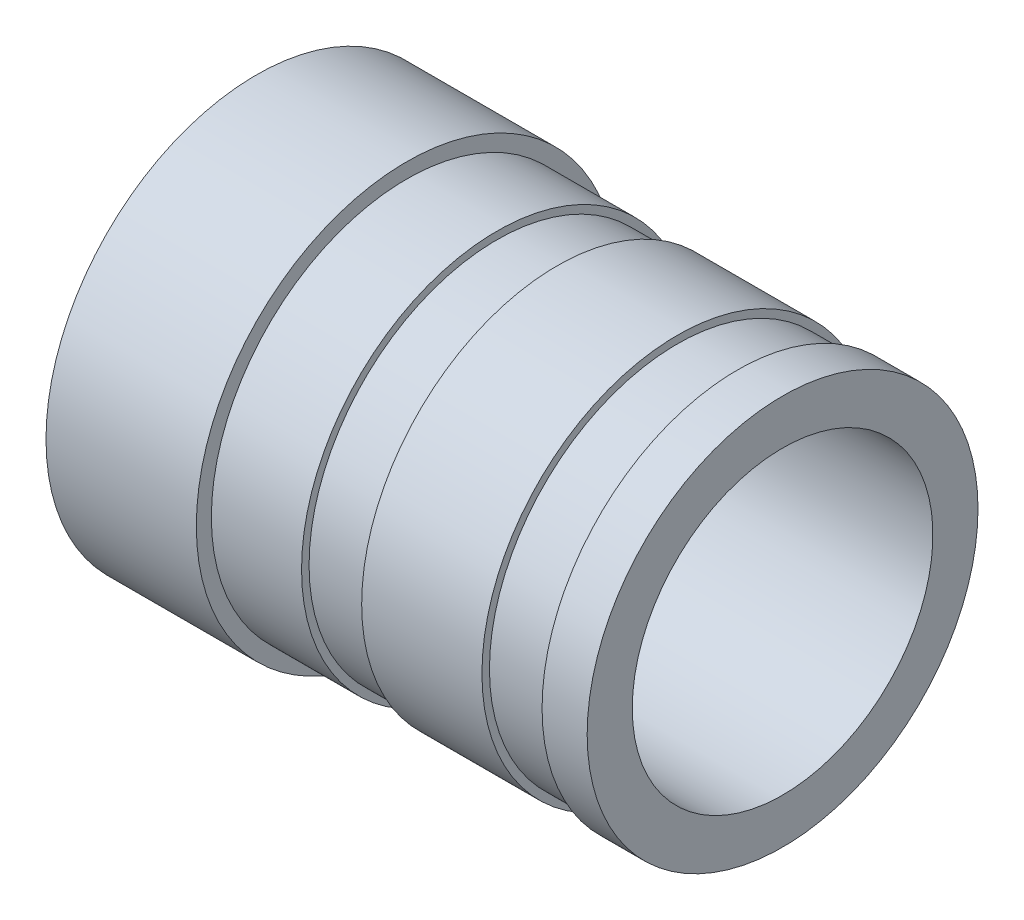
from build123d import *

# Parameters (mm, degrees)
ESQUISSE3_W             = 4
ESQUISSE3_H             = 15.398853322
ESQUISSE3_H_2           = 17.699831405
ESQUISSE4_R             = 5
ENL_V_MAT_EXTRU_1_DEPTH = 41.211938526


with BuildPart() as part:
    # Esquisse1 → Base-R_volution (revolve)
    with BuildSketch(Plane.XY, mode=Mode.PRIVATE) as base_r_volution_sk:
        Polygon((35, 10), (15.8, 10), (15.8, 0), (0, 0), (0, 14), (10, 14), (10, 13), (35, 13), align=None)
    revolve(base_r_volution_sk.sketch.rotate(Axis((0, 0, 0), (1, 0, 0)), 90), axis=Axis((0, 0, 0), (1, 0, 0)))

    # Esquisse3 → Enl_vement de mati_re-R_volution1 (revolve, cut)
    with BuildSketch(Plane.XY, mode=Mode.PRIVATE) as enl_vement_de_mati_re_r_volution1_sk:
        with Locations((18, 20.199426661)):
            Rectangle(ESQUISSE3_W, ESQUISSE3_H)
        with Locations((30, 21.349915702)):
            Rectangle(ESQUISSE3_W, ESQUISSE3_H_2)
    revolve(enl_vement_de_mati_re_r_volution1_sk.sketch.rotate(Axis((0, 0, 0), (1, 0, 0)), 90), axis=Axis((0, 0, 0), (1, 0, 0)), mode=Mode.SUBTRACT)

    # Esquisse4 → Enl_v. mat.-Extru.1 (cut, through all)
    with BuildSketch(Plane.ZY):
        Circle(ESQUISSE4_R)
    extrude(amount=-ENL_V_MAT_EXTRU_1_DEPTH, mode=Mode.SUBTRACT)


solid = part.part
